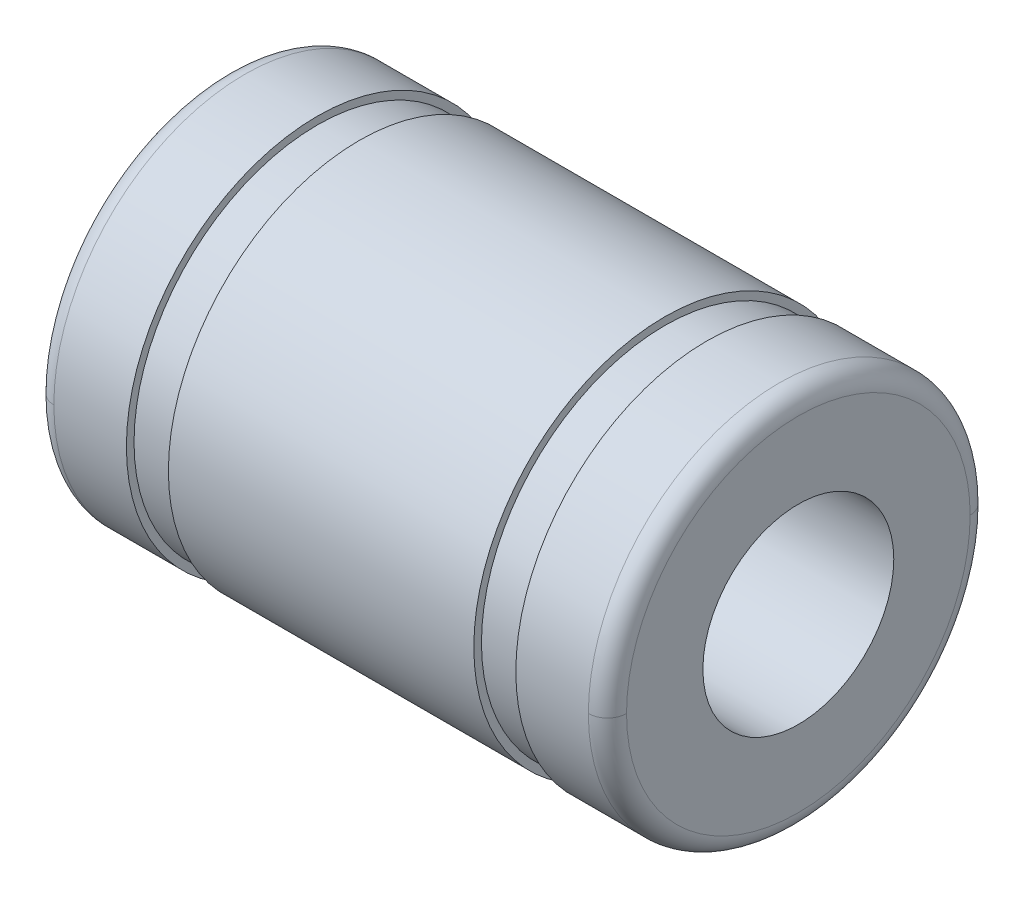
ISO-10303-21;
HEADER;
FILE_DESCRIPTION(('STEP AP214'),'2;1');
FILE_NAME('part.step','',(''),(''),'','','');
FILE_SCHEMA(('AUTOMOTIVE_DESIGN { 1 0 10303 214 1 1 1 1 }'));
ENDSEC;
DATA;
#1=APPLICATION_CONTEXT('core data for automotive mechanical design processes');
#2=APPLICATION_PROTOCOL_DEFINITION('international standard','automotive_design',2000,#1);
#3=PRODUCT_CONTEXT('',#1,'mechanical');
#4=PRODUCT('Part','Part','',(#3));
#5=PRODUCT_RELATED_PRODUCT_CATEGORY('part','',(#4));
#6=PRODUCT_DEFINITION_FORMATION('','',#4);
#7=PRODUCT_DEFINITION_CONTEXT('part definition',#1,'design');
#8=PRODUCT_DEFINITION('design','',#6,#7);
#9=PRODUCT_DEFINITION_SHAPE('','',#8);
#10=(LENGTH_UNIT() NAMED_UNIT(*) SI_UNIT(.MILLI.,.METRE.));
#11=(NAMED_UNIT(*) PLANE_ANGLE_UNIT() SI_UNIT($,.RADIAN.));
#12=(NAMED_UNIT(*) SI_UNIT($,.STERADIAN.) SOLID_ANGLE_UNIT());
#13=UNCERTAINTY_MEASURE_WITH_UNIT(LENGTH_MEASURE(1.E-05),#10,'distance_accuracy_value','');
#14=(GEOMETRIC_REPRESENTATION_CONTEXT(3) GLOBAL_UNCERTAINTY_ASSIGNED_CONTEXT((#13)) GLOBAL_UNIT_ASSIGNED_CONTEXT((#10,
#11,#12)) REPRESENTATION_CONTEXT('',''));
#15=CARTESIAN_POINT('',(0.,0.,0.));
#16=DIRECTION('',(0.,0.,1.));
#17=DIRECTION('',(1.,0.,0.));
#18=AXIS2_PLACEMENT_3D('',#15,#16,#17);
#19=CARTESIAN_POINT('',(7.5,0.,0.));
#20=DIRECTION('',(-1.,0.,0.));
#21=DIRECTION('',(0.,0.,-1.));
#22=AXIS2_PLACEMENT_3D('',#19,#20,#21);
#23=CYLINDRICAL_SURFACE('',#22,5.);
#24=DIRECTION('',(1.,0.,0.));
#25=VECTOR('',#24,1.);
#26=CARTESIAN_POINT('',(7.5,0.,5.));
#27=LINE('',#26,#25);
#28=CARTESIAN_POINT('',(-7.,0.,5.));
#29=VERTEX_POINT('',#28);
#30=CARTESIAN_POINT('',(-5.1,0.,5.));
#31=VERTEX_POINT('',#30);
#32=EDGE_CURVE('E187',#29,#31,#27,.T.);
#33=ORIENTED_EDGE('',*,*,#32,.F.);
#34=CARTESIAN_POINT('',(-7.,0.,0.));
#35=DIRECTION('',(-1.,0.,0.));
#36=DIRECTION('',(0.,0.,1.));
#37=AXIS2_PLACEMENT_3D('',#34,#35,#36);
#38=CIRCLE('',#37,5.);
#39=CARTESIAN_POINT('',(-7.,0.,-5.));
#40=VERTEX_POINT('',#39);
#41=EDGE_CURVE('E203',#29,#40,#38,.F.);
#42=ORIENTED_EDGE('',*,*,#41,.T.);
#43=CARTESIAN_POINT('',(-7.,0.,0.));
#44=DIRECTION('',(-1.,0.,0.));
#45=DIRECTION('',(0.,0.,1.));
#46=AXIS2_PLACEMENT_3D('',#43,#44,#45);
#47=CIRCLE('',#46,5.);
#48=EDGE_CURVE('E200',#40,#29,#47,.F.);
#49=ORIENTED_EDGE('',*,*,#48,.T.);
#50=ORIENTED_EDGE('',*,*,#32,.T.);
#51=CARTESIAN_POINT('',(-5.1,0.,0.));
#52=DIRECTION('',(1.,0.,0.));
#53=DIRECTION('',(0.,0.,-1.));
#54=AXIS2_PLACEMENT_3D('',#51,#52,#53);
#55=CIRCLE('',#54,5.);
#56=CARTESIAN_POINT('',(-5.1,0.,-5.));
#57=VERTEX_POINT('',#56);
#58=EDGE_CURVE('E183',#57,#31,#55,.T.);
#59=ORIENTED_EDGE('',*,*,#58,.F.);
#60=CARTESIAN_POINT('',(-5.1,0.,0.));
#61=DIRECTION('',(1.,0.,0.));
#62=DIRECTION('',(0.,0.,-1.));
#63=AXIS2_PLACEMENT_3D('',#60,#61,#62);
#64=CIRCLE('',#63,5.);
#65=EDGE_CURVE('E180',#31,#57,#64,.T.);
#66=ORIENTED_EDGE('',*,*,#65,.F.);
#67=EDGE_LOOP('',(#33,#42,#49,#50,#59,#66));
#68=FACE_BOUND('',#67,.T.);
#69=ADVANCED_FACE('F55',(#68),#23,.T.);
#70=CARTESIAN_POINT('',(-5.1,4.8,0.));
#71=DIRECTION('',(1.,0.,0.));
#72=DIRECTION('',(0.,1.,0.));
#73=AXIS2_PLACEMENT_3D('',#70,#71,#72);
#74=PLANE('',#73);
#75=CARTESIAN_POINT('',(-5.1,0.,0.));
#76=DIRECTION('',(1.,0.,0.));
#77=DIRECTION('',(0.,0.,-1.));
#78=AXIS2_PLACEMENT_3D('',#75,#76,#77);
#79=CIRCLE('',#78,4.8);
#80=CARTESIAN_POINT('',(-5.1,0.,-4.8));
#81=VERTEX_POINT('',#80);
#82=CARTESIAN_POINT('',(-5.1,0.,4.8));
#83=VERTEX_POINT('',#82);
#84=EDGE_CURVE('E360',#81,#83,#79,.T.);
#85=ORIENTED_EDGE('',*,*,#84,.F.);
#86=CARTESIAN_POINT('',(-5.1,0.,0.));
#87=DIRECTION('',(1.,0.,0.));
#88=DIRECTION('',(0.,0.,-1.));
#89=AXIS2_PLACEMENT_3D('',#86,#87,#88);
#90=CIRCLE('',#89,4.8);
#91=EDGE_CURVE('E190',#83,#81,#90,.T.);
#92=ORIENTED_EDGE('',*,*,#91,.F.);
#93=EDGE_LOOP('',(#85,#92));
#94=FACE_BOUND('',#93,.T.);
#95=ORIENTED_EDGE('',*,*,#58,.T.);
#96=ORIENTED_EDGE('',*,*,#65,.T.);
#97=EDGE_LOOP('',(#95,#96));
#98=FACE_BOUND('',#97,.T.);
#99=ADVANCED_FACE('F182',(#94,#98),#74,.T.);
#100=CARTESIAN_POINT('',(7.5,0.,0.));
#101=DIRECTION('',(-1.,0.,0.));
#102=DIRECTION('',(0.,0.,-1.));
#103=AXIS2_PLACEMENT_3D('',#100,#101,#102);
#104=CYLINDRICAL_SURFACE('',#103,4.8);
#105=ORIENTED_EDGE('',*,*,#84,.T.);
#106=DIRECTION('',(1.,0.,0.));
#107=VECTOR('',#106,1.);
#108=CARTESIAN_POINT('',(7.5,0.,4.8));
#109=LINE('',#108,#107);
#110=CARTESIAN_POINT('',(-4.,0.,4.8));
#111=VERTEX_POINT('',#110);
#112=EDGE_CURVE('E194',#83,#111,#109,.T.);
#113=ORIENTED_EDGE('',*,*,#112,.T.);
#114=CARTESIAN_POINT('',(-4.,0.,0.));
#115=DIRECTION('',(1.,0.,0.));
#116=DIRECTION('',(0.,0.,-1.));
#117=AXIS2_PLACEMENT_3D('',#114,#115,#116);
#118=CIRCLE('',#117,4.8);
#119=CARTESIAN_POINT('',(-4.,0.,-4.8));
#120=VERTEX_POINT('',#119);
#121=EDGE_CURVE('E347',#120,#111,#118,.T.);
#122=ORIENTED_EDGE('',*,*,#121,.F.);
#123=CARTESIAN_POINT('',(-4.,0.,0.));
#124=DIRECTION('',(1.,0.,0.));
#125=DIRECTION('',(0.,0.,-1.));
#126=AXIS2_PLACEMENT_3D('',#123,#124,#125);
#127=CIRCLE('',#126,4.8);
#128=EDGE_CURVE('E354',#111,#120,#127,.T.);
#129=ORIENTED_EDGE('',*,*,#128,.F.);
#130=ORIENTED_EDGE('',*,*,#112,.F.);
#131=ORIENTED_EDGE('',*,*,#91,.T.);
#132=EDGE_LOOP('',(#105,#113,#122,#129,#130,#131));
#133=FACE_BOUND('',#132,.T.);
#134=ADVANCED_FACE('F389',(#133),#104,.T.);
#135=CARTESIAN_POINT('',(-4.,5.,0.));
#136=DIRECTION('',(-1.,0.,0.));
#137=DIRECTION('',(0.,0.,1.));
#138=AXIS2_PLACEMENT_3D('',#135,#136,#137);
#139=PLANE('',#138);
#140=ORIENTED_EDGE('',*,*,#121,.T.);
#141=ORIENTED_EDGE('',*,*,#128,.T.);
#142=EDGE_LOOP('',(#140,#141));
#143=FACE_BOUND('',#142,.T.);
#144=CARTESIAN_POINT('',(-4.,0.,0.));
#145=DIRECTION('',(1.,0.,0.));
#146=DIRECTION('',(0.,0.,-1.));
#147=AXIS2_PLACEMENT_3D('',#144,#145,#146);
#148=CIRCLE('',#147,5.);
#149=CARTESIAN_POINT('',(-4.,0.,-5.));
#150=VERTEX_POINT('',#149);
#151=CARTESIAN_POINT('',(-4.,0.,5.));
#152=VERTEX_POINT('',#151);
#153=EDGE_CURVE('E328',#150,#152,#148,.T.);
#154=ORIENTED_EDGE('',*,*,#153,.F.);
#155=CARTESIAN_POINT('',(-4.,0.,0.));
#156=DIRECTION('',(1.,0.,0.));
#157=DIRECTION('',(0.,0.,-1.));
#158=AXIS2_PLACEMENT_3D('',#155,#156,#157);
#159=CIRCLE('',#158,5.);
#160=EDGE_CURVE('E341',#152,#150,#159,.T.);
#161=ORIENTED_EDGE('',*,*,#160,.F.);
#162=EDGE_LOOP('',(#154,#161));
#163=FACE_BOUND('',#162,.T.);
#164=ADVANCED_FACE('F402',(#143,#163),#139,.T.);
#165=CARTESIAN_POINT('',(7.5,0.,0.));
#166=DIRECTION('',(-1.,0.,0.));
#167=DIRECTION('',(0.,0.,-1.));
#168=AXIS2_PLACEMENT_3D('',#165,#166,#167);
#169=CYLINDRICAL_SURFACE('',#168,5.);
#170=ORIENTED_EDGE('',*,*,#153,.T.);
#171=DIRECTION('',(1.,0.,0.));
#172=VECTOR('',#171,1.);
#173=CARTESIAN_POINT('',(7.5,0.,5.));
#174=LINE('',#173,#172);
#175=CARTESIAN_POINT('',(4.,0.,5.));
#176=VERTEX_POINT('',#175);
#177=EDGE_CURVE('E335',#152,#176,#174,.T.);
#178=ORIENTED_EDGE('',*,*,#177,.T.);
#179=CARTESIAN_POINT('',(4.,0.,0.));
#180=DIRECTION('',(1.,0.,0.));
#181=DIRECTION('',(0.,0.,-1.));
#182=AXIS2_PLACEMENT_3D('',#179,#180,#181);
#183=CIRCLE('',#182,5.);
#184=CARTESIAN_POINT('',(4.,0.,-5.));
#185=VERTEX_POINT('',#184);
#186=EDGE_CURVE('E315',#185,#176,#183,.T.);
#187=ORIENTED_EDGE('',*,*,#186,.F.);
#188=CARTESIAN_POINT('',(4.,0.,0.));
#189=DIRECTION('',(1.,0.,0.));
#190=DIRECTION('',(0.,0.,-1.));
#191=AXIS2_PLACEMENT_3D('',#188,#189,#190);
#192=CIRCLE('',#191,5.);
#193=EDGE_CURVE('E322',#176,#185,#192,.T.);
#194=ORIENTED_EDGE('',*,*,#193,.F.);
#195=ORIENTED_EDGE('',*,*,#177,.F.);
#196=ORIENTED_EDGE('',*,*,#160,.T.);
#197=EDGE_LOOP('',(#170,#178,#187,#194,#195,#196));
#198=FACE_BOUND('',#197,.T.);
#199=ADVANCED_FACE('F406',(#198),#169,.T.);
#200=CARTESIAN_POINT('',(4.,4.8,0.));
#201=DIRECTION('',(1.,0.,0.));
#202=DIRECTION('',(0.,1.,0.));
#203=AXIS2_PLACEMENT_3D('',#200,#201,#202);
#204=PLANE('',#203);
#205=CARTESIAN_POINT('',(4.,0.,0.));
#206=DIRECTION('',(1.,0.,0.));
#207=DIRECTION('',(0.,0.,-1.));
#208=AXIS2_PLACEMENT_3D('',#205,#206,#207);
#209=CIRCLE('',#208,4.8);
#210=CARTESIAN_POINT('',(4.,0.,-4.8));
#211=VERTEX_POINT('',#210);
#212=CARTESIAN_POINT('',(4.,0.,4.8));
#213=VERTEX_POINT('',#212);
#214=EDGE_CURVE('E296',#211,#213,#209,.T.);
#215=ORIENTED_EDGE('',*,*,#214,.F.);
#216=CARTESIAN_POINT('',(4.,0.,0.));
#217=DIRECTION('',(1.,0.,0.));
#218=DIRECTION('',(0.,0.,-1.));
#219=AXIS2_PLACEMENT_3D('',#216,#217,#218);
#220=CIRCLE('',#219,4.8);
#221=EDGE_CURVE('E309',#213,#211,#220,.T.);
#222=ORIENTED_EDGE('',*,*,#221,.F.);
#223=EDGE_LOOP('',(#215,#222));
#224=FACE_BOUND('',#223,.T.);
#225=ORIENTED_EDGE('',*,*,#186,.T.);
#226=ORIENTED_EDGE('',*,*,#193,.T.);
#227=EDGE_LOOP('',(#225,#226));
#228=FACE_BOUND('',#227,.T.);
#229=ADVANCED_FACE('F415',(#224,#228),#204,.T.);
#230=CARTESIAN_POINT('',(7.5,0.,0.));
#231=DIRECTION('',(-1.,0.,0.));
#232=DIRECTION('',(0.,0.,-1.));
#233=AXIS2_PLACEMENT_3D('',#230,#231,#232);
#234=CYLINDRICAL_SURFACE('',#233,4.8);
#235=ORIENTED_EDGE('',*,*,#214,.T.);
#236=DIRECTION('',(1.,0.,0.));
#237=VECTOR('',#236,1.);
#238=CARTESIAN_POINT('',(7.5,0.,4.8));
#239=LINE('',#238,#237);
#240=CARTESIAN_POINT('',(5.1,0.,4.8));
#241=VERTEX_POINT('',#240);
#242=EDGE_CURVE('E303',#213,#241,#239,.T.);
#243=ORIENTED_EDGE('',*,*,#242,.T.);
#244=CARTESIAN_POINT('',(5.1,0.,0.));
#245=DIRECTION('',(1.,0.,0.));
#246=DIRECTION('',(0.,0.,-1.));
#247=AXIS2_PLACEMENT_3D('',#244,#245,#246);
#248=CIRCLE('',#247,4.8);
#249=CARTESIAN_POINT('',(5.1,0.,-4.8));
#250=VERTEX_POINT('',#249);
#251=EDGE_CURVE('E283',#250,#241,#248,.T.);
#252=ORIENTED_EDGE('',*,*,#251,.F.);
#253=CARTESIAN_POINT('',(5.1,0.,0.));
#254=DIRECTION('',(1.,0.,0.));
#255=DIRECTION('',(0.,0.,-1.));
#256=AXIS2_PLACEMENT_3D('',#253,#254,#255);
#257=CIRCLE('',#256,4.8);
#258=EDGE_CURVE('E290',#241,#250,#257,.T.);
#259=ORIENTED_EDGE('',*,*,#258,.F.);
#260=ORIENTED_EDGE('',*,*,#242,.F.);
#261=ORIENTED_EDGE('',*,*,#221,.T.);
#262=EDGE_LOOP('',(#235,#243,#252,#259,#260,#261));
#263=FACE_BOUND('',#262,.T.);
#264=ADVANCED_FACE('F432',(#263),#234,.T.);
#265=CARTESIAN_POINT('',(5.1,5.,0.));
#266=DIRECTION('',(-1.,0.,0.));
#267=DIRECTION('',(0.,0.,1.));
#268=AXIS2_PLACEMENT_3D('',#265,#266,#267);
#269=PLANE('',#268);
#270=ORIENTED_EDGE('',*,*,#251,.T.);
#271=ORIENTED_EDGE('',*,*,#258,.T.);
#272=EDGE_LOOP('',(#270,#271));
#273=FACE_BOUND('',#272,.T.);
#274=CARTESIAN_POINT('',(5.1,0.,0.));
#275=DIRECTION('',(1.,0.,0.));
#276=DIRECTION('',(0.,0.,-1.));
#277=AXIS2_PLACEMENT_3D('',#274,#275,#276);
#278=CIRCLE('',#277,5.);
#279=CARTESIAN_POINT('',(5.1,0.,-5.));
#280=VERTEX_POINT('',#279);
#281=CARTESIAN_POINT('',(5.1,0.,5.));
#282=VERTEX_POINT('',#281);
#283=EDGE_CURVE('E264',#280,#282,#278,.T.);
#284=ORIENTED_EDGE('',*,*,#283,.F.);
#285=CARTESIAN_POINT('',(5.1,0.,0.));
#286=DIRECTION('',(1.,0.,0.));
#287=DIRECTION('',(0.,0.,-1.));
#288=AXIS2_PLACEMENT_3D('',#285,#286,#287);
#289=CIRCLE('',#288,5.);
#290=EDGE_CURVE('E277',#282,#280,#289,.T.);
#291=ORIENTED_EDGE('',*,*,#290,.F.);
#292=EDGE_LOOP('',(#284,#291));
#293=FACE_BOUND('',#292,.T.);
#294=ADVANCED_FACE('F438',(#273,#293),#269,.T.);
#295=CARTESIAN_POINT('',(7.5,0.,0.));
#296=DIRECTION('',(-1.,0.,0.));
#297=DIRECTION('',(0.,0.,-1.));
#298=AXIS2_PLACEMENT_3D('',#295,#296,#297);
#299=CYLINDRICAL_SURFACE('',#298,5.);
#300=CARTESIAN_POINT('',(7.,0.,0.));
#301=DIRECTION('',(1.,0.,0.));
#302=DIRECTION('',(0.,0.,-1.));
#303=AXIS2_PLACEMENT_3D('',#300,#301,#302);
#304=CIRCLE('',#303,5.);
#305=CARTESIAN_POINT('',(7.,0.,5.));
#306=VERTEX_POINT('',#305);
#307=CARTESIAN_POINT('',(7.,0.,-5.));
#308=VERTEX_POINT('',#307);
#309=EDGE_CURVE('E65',#306,#308,#304,.F.);
#310=ORIENTED_EDGE('',*,*,#309,.T.);
#311=CARTESIAN_POINT('',(7.,0.,0.));
#312=DIRECTION('',(1.,0.,0.));
#313=DIRECTION('',(0.,0.,-1.));
#314=AXIS2_PLACEMENT_3D('',#311,#312,#313);
#315=CIRCLE('',#314,5.);
#316=EDGE_CURVE('E11',#308,#306,#315,.F.);
#317=ORIENTED_EDGE('',*,*,#316,.T.);
#318=DIRECTION('',(1.,0.,0.));
#319=VECTOR('',#318,1.);
#320=CARTESIAN_POINT('',(7.5,0.,5.));
#321=LINE('',#320,#319);
#322=EDGE_CURVE('E271',#282,#306,#321,.T.);
#323=ORIENTED_EDGE('',*,*,#322,.F.);
#324=ORIENTED_EDGE('',*,*,#290,.T.);
#325=ORIENTED_EDGE('',*,*,#283,.T.);
#326=ORIENTED_EDGE('',*,*,#322,.T.);
#327=EDGE_LOOP('',(#310,#317,#323,#324,#325,#326));
#328=FACE_BOUND('',#327,.T.);
#329=ADVANCED_FACE('F442',(#328),#299,.T.);
#330=CARTESIAN_POINT('',(7.5,2.5,0.));
#331=DIRECTION('',(1.,0.,0.));
#332=DIRECTION('',(0.,1.,0.));
#333=AXIS2_PLACEMENT_3D('',#330,#331,#332);
#334=PLANE('',#333);
#335=CARTESIAN_POINT('',(7.5,0.,0.));
#336=DIRECTION('',(1.,0.,0.));
#337=DIRECTION('',(0.,0.,-1.));
#338=AXIS2_PLACEMENT_3D('',#335,#336,#337);
#339=CIRCLE('',#338,4.5);
#340=CARTESIAN_POINT('',(7.5,0.,-4.5));
#341=VERTEX_POINT('',#340);
#342=CARTESIAN_POINT('',(7.5,0.,4.5));
#343=VERTEX_POINT('',#342);
#344=EDGE_CURVE('E214',#341,#343,#339,.T.);
#345=ORIENTED_EDGE('',*,*,#344,.T.);
#346=CARTESIAN_POINT('',(7.5,0.,0.));
#347=DIRECTION('',(1.,0.,0.));
#348=DIRECTION('',(0.,0.,-1.));
#349=AXIS2_PLACEMENT_3D('',#346,#347,#348);
#350=CIRCLE('',#349,4.5);
#351=EDGE_CURVE('E217',#343,#341,#350,.T.);
#352=ORIENTED_EDGE('',*,*,#351,.T.);
#353=EDGE_LOOP('',(#345,#352));
#354=FACE_BOUND('',#353,.T.);
#355=CARTESIAN_POINT('',(7.5,0.,0.));
#356=DIRECTION('',(1.,0.,0.));
#357=DIRECTION('',(0.,0.,-1.));
#358=AXIS2_PLACEMENT_3D('',#355,#356,#357);
#359=CIRCLE('',#358,2.5);
#360=CARTESIAN_POINT('',(7.5,0.,-2.5));
#361=VERTEX_POINT('',#360);
#362=CARTESIAN_POINT('',(7.5,0.,2.5));
#363=VERTEX_POINT('',#362);
#364=EDGE_CURVE('E245',#361,#363,#359,.T.);
#365=ORIENTED_EDGE('',*,*,#364,.F.);
#366=CARTESIAN_POINT('',(7.5,0.,0.));
#367=DIRECTION('',(1.,0.,0.));
#368=DIRECTION('',(0.,0.,-1.));
#369=AXIS2_PLACEMENT_3D('',#366,#367,#368);
#370=CIRCLE('',#369,2.5);
#371=EDGE_CURVE('E258',#363,#361,#370,.T.);
#372=ORIENTED_EDGE('',*,*,#371,.F.);
#373=EDGE_LOOP('',(#365,#372));
#374=FACE_BOUND('',#373,.T.);
#375=ADVANCED_FACE('F451',(#354,#374),#334,.T.);
#376=CARTESIAN_POINT('',(7.5,0.,0.));
#377=DIRECTION('',(-1.,0.,0.));
#378=DIRECTION('',(0.,0.,-1.));
#379=AXIS2_PLACEMENT_3D('',#376,#377,#378);
#380=CYLINDRICAL_SURFACE('',#379,2.5);
#381=ORIENTED_EDGE('',*,*,#364,.T.);
#382=DIRECTION('',(-1.,0.,0.));
#383=VECTOR('',#382,1.);
#384=CARTESIAN_POINT('',(7.5,0.,2.5));
#385=LINE('',#384,#383);
#386=CARTESIAN_POINT('',(-7.5,0.,2.5));
#387=VERTEX_POINT('',#386);
#388=EDGE_CURVE('E252',#363,#387,#385,.T.);
#389=ORIENTED_EDGE('',*,*,#388,.T.);
#390=CARTESIAN_POINT('',(-7.5,0.,0.));
#391=DIRECTION('',(1.,0.,0.));
#392=DIRECTION('',(0.,0.,-1.));
#393=AXIS2_PLACEMENT_3D('',#390,#391,#392);
#394=CIRCLE('',#393,2.5);
#395=CARTESIAN_POINT('',(-7.5,0.,-2.5));
#396=VERTEX_POINT('',#395);
#397=EDGE_CURVE('E228',#396,#387,#394,.T.);
#398=ORIENTED_EDGE('',*,*,#397,.F.);
#399=CARTESIAN_POINT('',(-7.5,0.,0.));
#400=DIRECTION('',(1.,0.,0.));
#401=DIRECTION('',(0.,0.,-1.));
#402=AXIS2_PLACEMENT_3D('',#399,#400,#401);
#403=CIRCLE('',#402,2.5);
#404=EDGE_CURVE('E238',#387,#396,#403,.T.);
#405=ORIENTED_EDGE('',*,*,#404,.F.);
#406=ORIENTED_EDGE('',*,*,#388,.F.);
#407=ORIENTED_EDGE('',*,*,#371,.T.);
#408=EDGE_LOOP('',(#381,#389,#398,#405,#406,#407));
#409=FACE_BOUND('',#408,.T.);
#410=ADVANCED_FACE('F467',(#409),#380,.F.);
#411=CARTESIAN_POINT('',(-7.5,5.,0.));
#412=DIRECTION('',(-1.,0.,0.));
#413=DIRECTION('',(0.,0.,1.));
#414=AXIS2_PLACEMENT_3D('',#411,#412,#413);
#415=PLANE('',#414);
#416=CARTESIAN_POINT('',(-7.5,0.,0.));
#417=DIRECTION('',(-1.,0.,0.));
#418=DIRECTION('',(0.,0.,1.));
#419=AXIS2_PLACEMENT_3D('',#416,#417,#418);
#420=CIRCLE('',#419,4.5);
#421=CARTESIAN_POINT('',(-7.5,0.,4.5));
#422=VERTEX_POINT('',#421);
#423=CARTESIAN_POINT('',(-7.5,0.,-4.5));
#424=VERTEX_POINT('',#423);
#425=EDGE_CURVE('E207',#422,#424,#420,.T.);
#426=ORIENTED_EDGE('',*,*,#425,.T.);
#427=CARTESIAN_POINT('',(-7.5,0.,0.));
#428=DIRECTION('',(-1.,0.,0.));
#429=DIRECTION('',(0.,0.,1.));
#430=AXIS2_PLACEMENT_3D('',#427,#428,#429);
#431=CIRCLE('',#430,4.5);
#432=EDGE_CURVE('E210',#424,#422,#431,.T.);
#433=ORIENTED_EDGE('',*,*,#432,.T.);
#434=EDGE_LOOP('',(#426,#433));
#435=FACE_BOUND('',#434,.T.);
#436=ORIENTED_EDGE('',*,*,#397,.T.);
#437=ORIENTED_EDGE('',*,*,#404,.T.);
#438=EDGE_LOOP('',(#436,#437));
#439=FACE_BOUND('',#438,.T.);
#440=ADVANCED_FACE('F476',(#435,#439),#415,.T.);
#441=CARTESIAN_POINT('',(-7.,0.,0.));
#442=DIRECTION('',(-1.,0.,0.));
#443=DIRECTION('',(0.,0.,1.));
#444=AXIS2_PLACEMENT_3D('',#441,#442,#443);
#445=TOROIDAL_SURFACE('',#444,4.5,0.5);
#446=CARTESIAN_POINT('',(-7.,0.,-4.5));
#447=DIRECTION('',(0.,-1.,0.));
#448=DIRECTION('',(0.,0.,-1.));
#449=AXIS2_PLACEMENT_3D('',#446,#447,#448);
#450=CIRCLE('',#449,0.5);
#451=EDGE_CURVE('E223',#424,#40,#450,.T.);
#452=ORIENTED_EDGE('',*,*,#451,.F.);
#453=ORIENTED_EDGE('',*,*,#425,.F.);
#454=CARTESIAN_POINT('',(-7.,0.,4.5));
#455=DIRECTION('',(0.,-1.,0.));
#456=DIRECTION('',(0.,0.,-1.));
#457=AXIS2_PLACEMENT_3D('',#454,#455,#456);
#458=CIRCLE('',#457,0.5);
#459=EDGE_CURVE('E226',#29,#422,#458,.T.);
#460=ORIENTED_EDGE('',*,*,#459,.F.);
#461=ORIENTED_EDGE('',*,*,#48,.F.);
#462=EDGE_LOOP('',(#452,#453,#460,#461));
#463=FACE_BOUND('',#462,.T.);
#464=ADVANCED_FACE('F483',(#463),#445,.T.);
#465=CARTESIAN_POINT('',(-7.,0.,0.));
#466=DIRECTION('',(-1.,0.,0.));
#467=DIRECTION('',(0.,0.,1.));
#468=AXIS2_PLACEMENT_3D('',#465,#466,#467);
#469=TOROIDAL_SURFACE('',#468,4.5,0.5);
#470=ORIENTED_EDGE('',*,*,#459,.T.);
#471=ORIENTED_EDGE('',*,*,#432,.F.);
#472=ORIENTED_EDGE('',*,*,#451,.T.);
#473=ORIENTED_EDGE('',*,*,#41,.F.);
#474=EDGE_LOOP('',(#470,#471,#472,#473));
#475=FACE_BOUND('',#474,.T.);
#476=ADVANCED_FACE('F551',(#475),#469,.T.);
#477=CARTESIAN_POINT('',(7.,0.,0.));
#478=DIRECTION('',(1.,0.,0.));
#479=DIRECTION('',(0.,0.,-1.));
#480=AXIS2_PLACEMENT_3D('',#477,#478,#479);
#481=TOROIDAL_SURFACE('',#480,4.5,0.5);
#482=CARTESIAN_POINT('',(7.,0.,-4.5));
#483=DIRECTION('',(0.,-1.,0.));
#484=DIRECTION('',(0.,0.,-1.));
#485=AXIS2_PLACEMENT_3D('',#482,#483,#484);
#486=CIRCLE('',#485,0.5);
#487=EDGE_CURVE('E229',#308,#341,#486,.T.);
#488=ORIENTED_EDGE('',*,*,#487,.F.);
#489=ORIENTED_EDGE('',*,*,#309,.F.);
#490=CARTESIAN_POINT('',(7.,0.,4.5));
#491=DIRECTION('',(0.,-1.,0.));
#492=DIRECTION('',(0.,0.,-1.));
#493=AXIS2_PLACEMENT_3D('',#490,#491,#492);
#494=CIRCLE('',#493,0.5);
#495=EDGE_CURVE('E59',#343,#306,#494,.T.);
#496=ORIENTED_EDGE('',*,*,#495,.F.);
#497=ORIENTED_EDGE('',*,*,#344,.F.);
#498=EDGE_LOOP('',(#488,#489,#496,#497));
#499=FACE_BOUND('',#498,.T.);
#500=ADVANCED_FACE('F57',(#499),#481,.T.);
#501=CARTESIAN_POINT('',(7.,0.,0.));
#502=DIRECTION('',(1.,0.,0.));
#503=DIRECTION('',(0.,0.,-1.));
#504=AXIS2_PLACEMENT_3D('',#501,#502,#503);
#505=TOROIDAL_SURFACE('',#504,4.5,0.5);
#506=ORIENTED_EDGE('',*,*,#495,.T.);
#507=ORIENTED_EDGE('',*,*,#316,.F.);
#508=ORIENTED_EDGE('',*,*,#487,.T.);
#509=ORIENTED_EDGE('',*,*,#351,.F.);
#510=EDGE_LOOP('',(#506,#507,#508,#509));
#511=FACE_BOUND('',#510,.T.);
#512=ADVANCED_FACE('F574',(#511),#505,.T.);
#513=CLOSED_SHELL('',(#69,#99,#134,#164,#199,#229,#264,#294,#329,#375,#410,#440,#464,#476,#500,#512));
#514=MANIFOLD_SOLID_BREP('B2',#513);
#515=ADVANCED_BREP_SHAPE_REPRESENTATION('',(#18,#514),#14);
#516=SHAPE_DEFINITION_REPRESENTATION(#9,#515);
ENDSEC;
END-ISO-10303-21;
